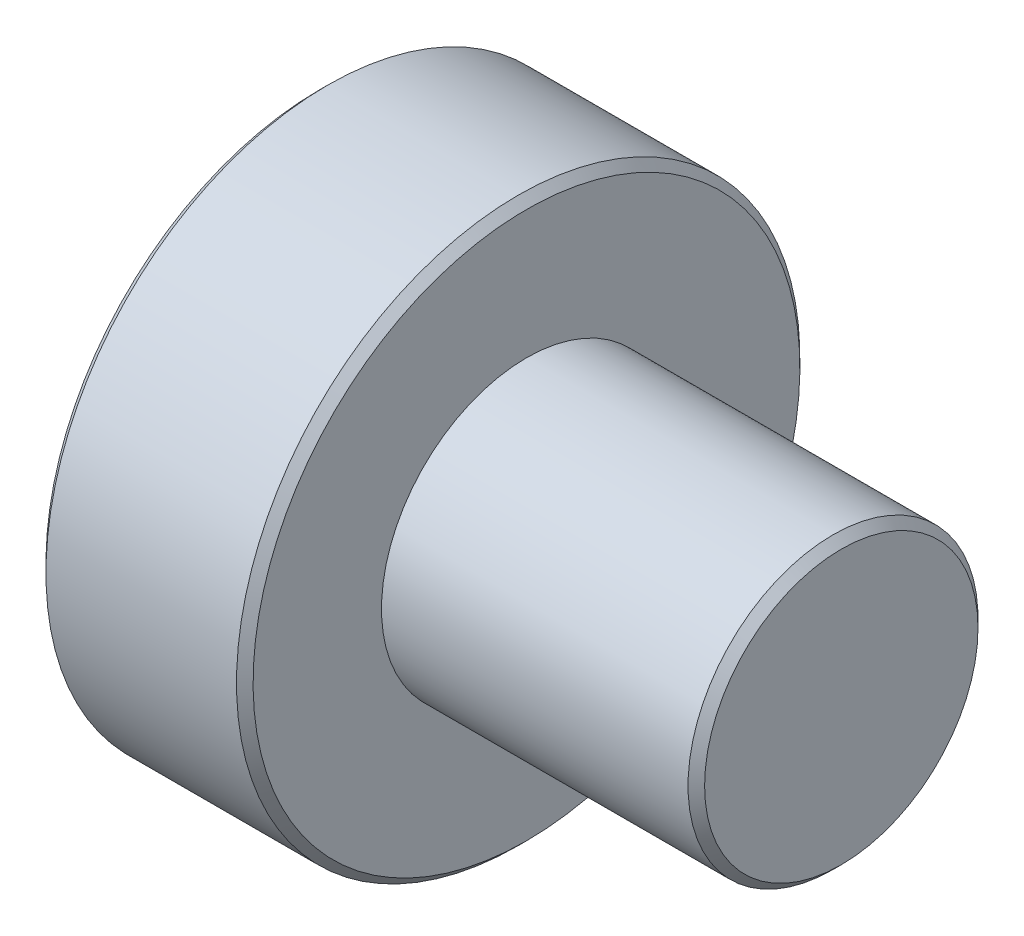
ISO-10303-21;
HEADER;
FILE_DESCRIPTION(('STEP AP214'),'2;1');
FILE_NAME('part.step','',(''),(''),'','','');
FILE_SCHEMA(('AUTOMOTIVE_DESIGN { 1 0 10303 214 1 1 1 1 }'));
ENDSEC;
DATA;
#1=APPLICATION_CONTEXT('core data for automotive mechanical design processes');
#2=APPLICATION_PROTOCOL_DEFINITION('international standard','automotive_design',2000,#1);
#3=PRODUCT_CONTEXT('',#1,'mechanical');
#4=PRODUCT('Part','Part','',(#3));
#5=PRODUCT_RELATED_PRODUCT_CATEGORY('part','',(#4));
#6=PRODUCT_DEFINITION_FORMATION('','',#4);
#7=PRODUCT_DEFINITION_CONTEXT('part definition',#1,'design');
#8=PRODUCT_DEFINITION('design','',#6,#7);
#9=PRODUCT_DEFINITION_SHAPE('','',#8);
#10=(LENGTH_UNIT() NAMED_UNIT(*) SI_UNIT(.MILLI.,.METRE.));
#11=(NAMED_UNIT(*) PLANE_ANGLE_UNIT() SI_UNIT($,.RADIAN.));
#12=(NAMED_UNIT(*) SI_UNIT($,.STERADIAN.) SOLID_ANGLE_UNIT());
#13=UNCERTAINTY_MEASURE_WITH_UNIT(LENGTH_MEASURE(1.E-05),#10,'distance_accuracy_value','');
#14=(GEOMETRIC_REPRESENTATION_CONTEXT(3) GLOBAL_UNCERTAINTY_ASSIGNED_CONTEXT((#13)) GLOBAL_UNIT_ASSIGNED_CONTEXT((#10,
#11,#12)) REPRESENTATION_CONTEXT('',''));
#15=CARTESIAN_POINT('',(0.,0.,0.));
#16=DIRECTION('',(0.,0.,1.));
#17=DIRECTION('',(1.,0.,0.));
#18=AXIS2_PLACEMENT_3D('',#15,#16,#17);
#19=CARTESIAN_POINT('',(-3.15,0.,0.));
#20=DIRECTION('',(1.,0.,0.));
#21=DIRECTION('',(0.,1.,0.));
#22=AXIS2_PLACEMENT_3D('',#19,#20,#21);
#23=PLANE('',#22);
#24=CARTESIAN_POINT('',(-3.15,0.,0.));
#25=DIRECTION('',(1.,0.,0.));
#26=DIRECTION('',(0.,1.,0.));
#27=AXIS2_PLACEMENT_3D('',#24,#25,#26);
#28=CIRCLE('',#27,3.3);
#29=CARTESIAN_POINT('',(-3.15,3.3,0.));
#30=VERTEX_POINT('',#29);
#31=EDGE_CURVE('E10',#30,#30,#28,.F.);
#32=ORIENTED_EDGE('',*,*,#31,.T.);
#33=EDGE_LOOP('',(#32));
#34=FACE_BOUND('',#33,.T.);
#35=ADVANCED_FACE('F39',(#34),#23,.F.);
#36=CARTESIAN_POINT('',(-3.15,0.,0.));
#37=DIRECTION('',(-1.,0.,0.));
#38=DIRECTION('',(0.,-1.,0.));
#39=AXIS2_PLACEMENT_3D('',#36,#37,#38);
#40=CYLINDRICAL_SURFACE('',#39,3.4);
#41=CARTESIAN_POINT('',(-0.750000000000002,0.,0.));
#42=DIRECTION('',(-1.,0.,0.));
#43=DIRECTION('',(0.,-1.,0.));
#44=AXIS2_PLACEMENT_3D('',#41,#42,#43);
#45=CIRCLE('',#44,3.4);
#46=CARTESIAN_POINT('',(-0.750000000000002,-3.4,0.));
#47=VERTEX_POINT('',#46);
#48=EDGE_CURVE('E55',#47,#47,#45,.T.);
#49=ORIENTED_EDGE('',*,*,#48,.T.);
#50=EDGE_LOOP('',(#49));
#51=FACE_BOUND('',#50,.T.);
#52=CARTESIAN_POINT('',(-3.05,0.,0.));
#53=DIRECTION('',(1.,0.,0.));
#54=DIRECTION('',(0.,1.,0.));
#55=AXIS2_PLACEMENT_3D('',#52,#53,#54);
#56=CIRCLE('',#55,3.4);
#57=CARTESIAN_POINT('',(-3.05,3.4,0.));
#58=VERTEX_POINT('',#57);
#59=EDGE_CURVE('E59',#58,#58,#56,.T.);
#60=ORIENTED_EDGE('',*,*,#59,.T.);
#61=EDGE_LOOP('',(#60));
#62=FACE_BOUND('',#61,.T.);
#63=ADVANCED_FACE('F88',(#51,#62),#40,.T.);
#64=CARTESIAN_POINT('',(-0.65,3.4,0.));
#65=DIRECTION('',(-1.,0.,0.));
#66=DIRECTION('',(0.,-1.,0.));
#67=AXIS2_PLACEMENT_3D('',#64,#65,#66);
#68=PLANE('',#67);
#69=CARTESIAN_POINT('',(-0.65,0.,0.));
#70=DIRECTION('',(-1.,0.,0.));
#71=DIRECTION('',(0.,-1.,0.));
#72=AXIS2_PLACEMENT_3D('',#69,#70,#71);
#73=CIRCLE('',#72,3.3);
#74=CARTESIAN_POINT('',(-0.65,-3.3,0.));
#75=VERTEX_POINT('',#74);
#76=EDGE_CURVE('E48',#75,#75,#73,.F.);
#77=ORIENTED_EDGE('',*,*,#76,.T.);
#78=EDGE_LOOP('',(#77));
#79=FACE_BOUND('',#78,.T.);
#80=CARTESIAN_POINT('',(-0.65,0.,0.));
#81=DIRECTION('',(-1.,0.,0.));
#82=DIRECTION('',(0.,-1.,0.));
#83=AXIS2_PLACEMENT_3D('',#80,#81,#82);
#84=CIRCLE('',#83,1.75);
#85=CARTESIAN_POINT('',(-0.65,-1.75,0.));
#86=VERTEX_POINT('',#85);
#87=EDGE_CURVE('E70',#86,#86,#84,.T.);
#88=ORIENTED_EDGE('',*,*,#87,.T.);
#89=EDGE_LOOP('',(#88));
#90=FACE_BOUND('',#89,.T.);
#91=ADVANCED_FACE('F74',(#79,#90),#68,.F.);
#92=CARTESIAN_POINT('',(-3.15,0.,0.));
#93=DIRECTION('',(-1.,0.,0.));
#94=DIRECTION('',(0.,-1.,0.));
#95=AXIS2_PLACEMENT_3D('',#92,#93,#94);
#96=CYLINDRICAL_SURFACE('',#95,1.75);
#97=CARTESIAN_POINT('',(3.05,0.,0.));
#98=DIRECTION('',(-1.,0.,0.));
#99=DIRECTION('',(0.,-1.,0.));
#100=AXIS2_PLACEMENT_3D('',#97,#98,#99);
#101=CIRCLE('',#100,1.75);
#102=CARTESIAN_POINT('',(3.05,-1.75,0.));
#103=VERTEX_POINT('',#102);
#104=EDGE_CURVE('E67',#103,#103,#101,.T.);
#105=ORIENTED_EDGE('',*,*,#104,.T.);
#106=EDGE_LOOP('',(#105));
#107=FACE_BOUND('',#106,.T.);
#108=ORIENTED_EDGE('',*,*,#87,.F.);
#109=EDGE_LOOP('',(#108));
#110=FACE_BOUND('',#109,.T.);
#111=ADVANCED_FACE('F76',(#107,#110),#96,.T.);
#112=CARTESIAN_POINT('',(3.15,1.75,0.));
#113=DIRECTION('',(-1.,0.,0.));
#114=DIRECTION('',(0.,-1.,0.));
#115=AXIS2_PLACEMENT_3D('',#112,#113,#114);
#116=PLANE('',#115);
#117=CARTESIAN_POINT('',(3.15,0.,0.));
#118=DIRECTION('',(-1.,0.,0.));
#119=DIRECTION('',(0.,-1.,0.));
#120=AXIS2_PLACEMENT_3D('',#117,#118,#119);
#121=CIRCLE('',#120,1.65);
#122=CARTESIAN_POINT('',(3.15,-1.65,0.));
#123=VERTEX_POINT('',#122);
#124=EDGE_CURVE('E64',#123,#123,#121,.F.);
#125=ORIENTED_EDGE('',*,*,#124,.T.);
#126=EDGE_LOOP('',(#125));
#127=FACE_BOUND('',#126,.T.);
#128=ADVANCED_FACE('F78',(#127),#116,.F.);
#129=CARTESIAN_POINT('',(3.05,0.,0.));
#130=DIRECTION('',(-1.,0.,0.));
#131=DIRECTION('',(0.,-1.,0.));
#132=AXIS2_PLACEMENT_3D('',#129,#130,#131);
#133=CONICAL_SURFACE('',#132,1.75,0.785398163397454);
#134=ORIENTED_EDGE('',*,*,#124,.F.);
#135=EDGE_LOOP('',(#134));
#136=FACE_BOUND('',#135,.T.);
#137=ORIENTED_EDGE('',*,*,#104,.F.);
#138=EDGE_LOOP('',(#137));
#139=FACE_BOUND('',#138,.T.);
#140=ADVANCED_FACE('F85',(#136,#139),#133,.T.);
#141=CARTESIAN_POINT('',(-0.750000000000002,0.,0.));
#142=DIRECTION('',(-1.,0.,0.));
#143=DIRECTION('',(0.,-1.,0.));
#144=AXIS2_PLACEMENT_3D('',#141,#142,#143);
#145=CONICAL_SURFACE('',#144,3.4,0.785398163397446);
#146=ORIENTED_EDGE('',*,*,#76,.F.);
#147=EDGE_LOOP('',(#146));
#148=FACE_BOUND('',#147,.T.);
#149=ORIENTED_EDGE('',*,*,#48,.F.);
#150=EDGE_LOOP('',(#149));
#151=FACE_BOUND('',#150,.T.);
#152=ADVANCED_FACE('F103',(#148,#151),#145,.T.);
#153=CARTESIAN_POINT('',(-3.15,0.,0.));
#154=DIRECTION('',(1.,0.,0.));
#155=DIRECTION('',(0.,1.,0.));
#156=AXIS2_PLACEMENT_3D('',#153,#154,#155);
#157=CONICAL_SURFACE('',#156,3.3,0.785398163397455);
#158=ORIENTED_EDGE('',*,*,#59,.F.);
#159=EDGE_LOOP('',(#158));
#160=FACE_BOUND('',#159,.T.);
#161=ORIENTED_EDGE('',*,*,#31,.F.);
#162=EDGE_LOOP('',(#161));
#163=FACE_BOUND('',#162,.T.);
#164=ADVANCED_FACE('F42',(#160,#163),#157,.T.);
#165=CLOSED_SHELL('',(#35,#63,#91,#111,#128,#140,#152,#164));
#166=MANIFOLD_SOLID_BREP('B2',#165);
#167=ADVANCED_BREP_SHAPE_REPRESENTATION('',(#18,#166),#14);
#168=SHAPE_DEFINITION_REPRESENTATION(#9,#167);
ENDSEC;
END-ISO-10303-21;
